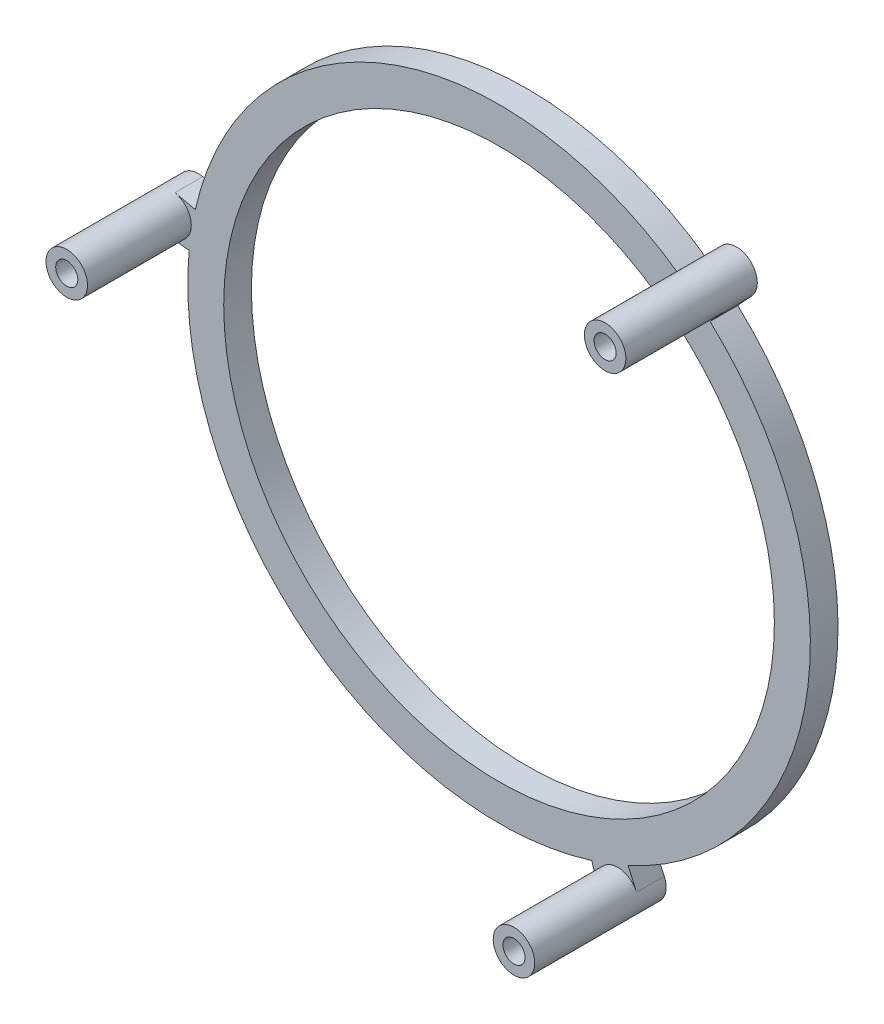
from build123d import *

# Parameters (mm, degrees)
SKETCH1_R      = 1.016
SKETCH1_R_2    = 25.273
EXTRUDE1_DEPTH = 2.54
SKETCH2_R      = 1.905
SKETCH2_R_2    = 1.016
EXTRUDE3_DEPTH = 9.525


with BuildPart() as part:
    # Sketch1 → Extrude1 (new body)
    with BuildSketch(Plane.XY):
        with BuildLine():
            Line((-21.224655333, 15.89436461), (-19.328498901, 15.711018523))
            ThreePointArc((-19.328498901, 15.711018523), (-8.907441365, -9.214920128), (17.622937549, -14.317846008))
            Line((17.622937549, -14.317846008), (18.190210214, -16.136424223))
            ThreePointArc((18.190210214, -16.136424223), (20.688396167, -17.348802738), (21.742581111, -14.779855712))
            Line((21.742581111, -14.779855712), (20.953285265, -13.046063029))
            ThreePointArc((20.953285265, -13.046063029), (37.329252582, 8.441806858), (28.483326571, 33.969251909))
            Line((28.483326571, 33.969251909), (29.774625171, 35.369813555))
            ThreePointArc((29.774625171, 35.369813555), (29.575482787, 38.139495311), (26.823616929, 37.76797274))
            Line((26.823616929, 37.76797274), (25.716756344, 36.217526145))
            ThreePointArc((25.716756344, 36.217526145), (-1.080268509, 39.65559491), (-18.764721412, 19.231075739))
            Line((-18.764721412, 19.231075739), (-20.623292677, 19.649092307))
            ThreePointArc((-20.623292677, 19.649092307), (-22.922336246, 18.091789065), (-21.224655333, 15.89436461))
        make_face()
        with Locations((-21.041309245, 17.790521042)):
            Circle(SKETCH1_R, mode=Mode.SUBTRACT)
        with Locations((9.113847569, 12.960827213)):
            Circle(SKETCH1_R_2, mode=Mode.SUBTRACT)
        with Locations((28.374063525, 36.661112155)):
            Circle(SKETCH1_R, mode=Mode.SUBTRACT)
        with Locations((20.008788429, -15.569151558)):
            Circle(SKETCH1_R, mode=Mode.SUBTRACT)
    extrude(amount=EXTRUDE1_DEPTH)

    # Sketch2 → Extrude3 (add)
    # profile 1 of 3: a face of its own
    with BuildSketch(Plane.XY.offset(2.54)):
        with Locations(Location((20.008788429, -15.569151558, 0), (0, 0, 197.324369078))):
            Circle(SKETCH2_R)
        with Locations((20.008788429, -15.569151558)):
            Circle(SKETCH2_R_2, mode=Mode.SUBTRACT)
    # profile 2 of 3: a face of its own
    with BuildSketch(Plane.XY.offset(2.54)):
        with Locations(Location((-21.041309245, 17.790521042, 0), (0, 0, 264.477037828))):
            Circle(SKETCH2_R)
        with Locations((-21.041309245, 17.790521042)):
            Circle(SKETCH2_R_2, mode=Mode.SUBTRACT)
    # profile 3 of 3: a face of its own
    with BuildSketch(Plane.XY.offset(2.54)):
        with Locations(Location((28.374063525, 36.661112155, 0), (0, 0, 144.477037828))):
            Circle(SKETCH2_R)
        with Locations((28.374063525, 36.661112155)):
            Circle(SKETCH2_R_2, mode=Mode.SUBTRACT)
    extrude(amount=EXTRUDE3_DEPTH)


solid = part.part
